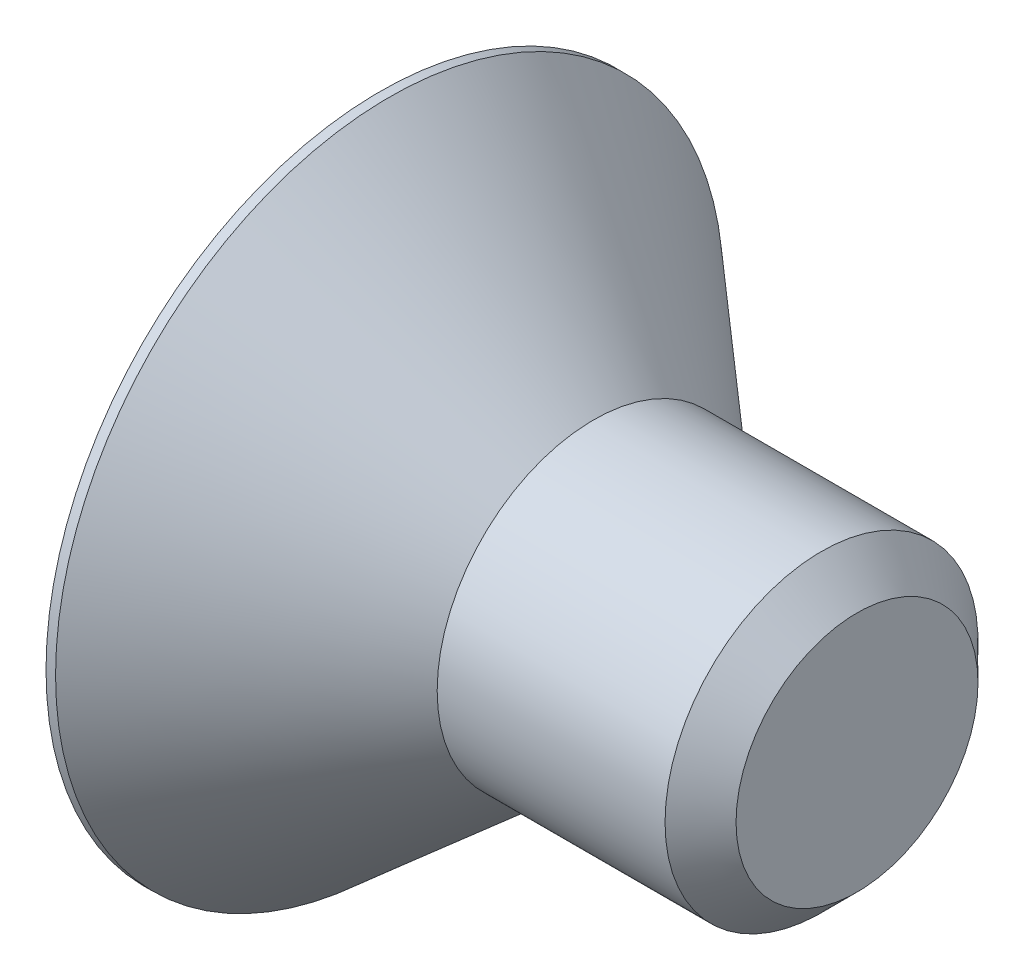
ISO-10303-21;
HEADER;
FILE_DESCRIPTION(('STEP AP214'),'2;1');
FILE_NAME('part.step','',(''),(''),'','','');
FILE_SCHEMA(('AUTOMOTIVE_DESIGN { 1 0 10303 214 1 1 1 1 }'));
ENDSEC;
DATA;
#1=APPLICATION_CONTEXT('core data for automotive mechanical design processes');
#2=APPLICATION_PROTOCOL_DEFINITION('international standard','automotive_design',2000,#1);
#3=PRODUCT_CONTEXT('',#1,'mechanical');
#4=PRODUCT('Part','Part','',(#3));
#5=PRODUCT_RELATED_PRODUCT_CATEGORY('part','',(#4));
#6=PRODUCT_DEFINITION_FORMATION('','',#4);
#7=PRODUCT_DEFINITION_CONTEXT('part definition',#1,'design');
#8=PRODUCT_DEFINITION('design','',#6,#7);
#9=PRODUCT_DEFINITION_SHAPE('','',#8);
#10=(LENGTH_UNIT() NAMED_UNIT(*) SI_UNIT(.MILLI.,.METRE.));
#11=(NAMED_UNIT(*) PLANE_ANGLE_UNIT() SI_UNIT($,.RADIAN.));
#12=(NAMED_UNIT(*) SI_UNIT($,.STERADIAN.) SOLID_ANGLE_UNIT());
#13=UNCERTAINTY_MEASURE_WITH_UNIT(LENGTH_MEASURE(1.E-05),#10,'distance_accuracy_value','');
#14=(GEOMETRIC_REPRESENTATION_CONTEXT(3) GLOBAL_UNCERTAINTY_ASSIGNED_CONTEXT((#13)) GLOBAL_UNIT_ASSIGNED_CONTEXT((#10,
#11,#12)) REPRESENTATION_CONTEXT('',''));
#15=CARTESIAN_POINT('',(0.,0.,0.));
#16=DIRECTION('',(0.,0.,1.));
#17=DIRECTION('',(1.,0.,0.));
#18=AXIS2_PLACEMENT_3D('',#15,#16,#17);
#19=CARTESIAN_POINT('',(0.,0.,0.));
#20=DIRECTION('',(-1.,0.,0.));
#21=DIRECTION('',(0.,0.,1.));
#22=AXIS2_PLACEMENT_3D('',#19,#20,#21);
#23=PLANE('',#22);
#24=CARTESIAN_POINT('',(0.,0.,0.));
#25=DIRECTION('',(-1.,0.,0.));
#26=DIRECTION('',(0.,0.,1.));
#27=AXIS2_PLACEMENT_3D('',#24,#25,#26);
#28=CIRCLE('',#27,4.445);
#29=CARTESIAN_POINT('',(0.,0.,4.445));
#30=VERTEX_POINT('',#29);
#31=EDGE_CURVE('E11',#30,#30,#28,.T.);
#32=ORIENTED_EDGE('',*,*,#31,.T.);
#33=EDGE_LOOP('',(#32));
#34=FACE_BOUND('',#33,.T.);
#35=DIRECTION('',(0.,-0.5,-0.866025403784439));
#36=VECTOR('',#35,1.);
#37=CARTESIAN_POINT('',(0.,-0.689240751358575,1.1938));
#38=LINE('',#37,#36);
#39=CARTESIAN_POINT('',(0.,-0.689240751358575,1.1938));
#40=VERTEX_POINT('',#39);
#41=CARTESIAN_POINT('',(0.,-1.37848150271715,0.));
#42=VERTEX_POINT('',#41);
#43=EDGE_CURVE('E116',#40,#42,#38,.T.);
#44=ORIENTED_EDGE('',*,*,#43,.T.);
#45=DIRECTION('',(0.,0.5,-0.866025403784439));
#46=VECTOR('',#45,1.);
#47=CARTESIAN_POINT('',(0.,-1.37848150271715,0.));
#48=LINE('',#47,#46);
#49=CARTESIAN_POINT('',(0.,-0.689240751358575,-1.1938));
#50=VERTEX_POINT('',#49);
#51=EDGE_CURVE('E47',#42,#50,#48,.T.);
#52=ORIENTED_EDGE('',*,*,#51,.T.);
#53=DIRECTION('',(0.,1.,0.));
#54=VECTOR('',#53,1.);
#55=CARTESIAN_POINT('',(0.,-0.689240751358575,-1.1938));
#56=LINE('',#55,#54);
#57=CARTESIAN_POINT('',(0.,0.689240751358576,-1.1938));
#58=VERTEX_POINT('',#57);
#59=EDGE_CURVE('E127',#50,#58,#56,.T.);
#60=ORIENTED_EDGE('',*,*,#59,.T.);
#61=DIRECTION('',(0.,0.5,0.866025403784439));
#62=VECTOR('',#61,1.);
#63=CARTESIAN_POINT('',(0.,0.689240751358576,-1.1938));
#64=LINE('',#63,#62);
#65=CARTESIAN_POINT('',(0.,1.37848150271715,0.));
#66=VERTEX_POINT('',#65);
#67=EDGE_CURVE('E198',#58,#66,#64,.T.);
#68=ORIENTED_EDGE('',*,*,#67,.T.);
#69=DIRECTION('',(0.,-0.5,0.866025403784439));
#70=VECTOR('',#69,1.);
#71=CARTESIAN_POINT('',(0.,1.37848150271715,0.));
#72=LINE('',#71,#70);
#73=CARTESIAN_POINT('',(0.,0.689240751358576,1.1938));
#74=VERTEX_POINT('',#73);
#75=EDGE_CURVE('E181',#66,#74,#72,.T.);
#76=ORIENTED_EDGE('',*,*,#75,.T.);
#77=DIRECTION('',(0.,-1.,0.));
#78=VECTOR('',#77,1.);
#79=CARTESIAN_POINT('',(0.,0.689240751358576,1.1938));
#80=LINE('',#79,#78);
#81=EDGE_CURVE('E176',#74,#40,#80,.T.);
#82=ORIENTED_EDGE('',*,*,#81,.T.);
#83=EDGE_LOOP('',(#44,#52,#60,#68,#76,#82));
#84=FACE_BOUND('',#83,.T.);
#85=ADVANCED_FACE('F33',(#34,#84),#23,.T.);
#86=CARTESIAN_POINT('',(0.,0.,0.));
#87=DIRECTION('',(-1.,0.,0.));
#88=DIRECTION('',(0.,0.,1.));
#89=AXIS2_PLACEMENT_3D('',#86,#87,#88);
#90=CYLINDRICAL_SURFACE('',#89,4.445);
#91=CARTESIAN_POINT('',(0.127,0.,0.));
#92=DIRECTION('',(-1.,0.,0.));
#93=DIRECTION('',(0.,0.,1.));
#94=AXIS2_PLACEMENT_3D('',#91,#92,#93);
#95=CIRCLE('',#94,4.445);
#96=CARTESIAN_POINT('',(0.127,0.,4.445));
#97=VERTEX_POINT('',#96);
#98=EDGE_CURVE('E40',#97,#97,#95,.T.);
#99=ORIENTED_EDGE('',*,*,#98,.T.);
#100=EDGE_LOOP('',(#99));
#101=FACE_BOUND('',#100,.T.);
#102=ORIENTED_EDGE('',*,*,#31,.F.);
#103=EDGE_LOOP('',(#102));
#104=FACE_BOUND('',#103,.T.);
#105=ADVANCED_FACE('F152',(#101,#104),#90,.T.);
#106=CARTESIAN_POINT('',(0.127,0.,0.));
#107=DIRECTION('',(-1.,0.,0.));
#108=DIRECTION('',(0.,0.,1.));
#109=AXIS2_PLACEMENT_3D('',#106,#107,#108);
#110=CONICAL_SURFACE('',#109,4.445,0.715584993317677);
#111=CARTESIAN_POINT('',(2.84440025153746,0.,0.));
#112=DIRECTION('',(-1.,0.,0.));
#113=DIRECTION('',(0.,0.,1.));
#114=AXIS2_PLACEMENT_3D('',#111,#112,#113);
#115=CIRCLE('',#114,2.0828);
#116=CARTESIAN_POINT('',(2.84440025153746,0.,2.0828));
#117=VERTEX_POINT('',#116);
#118=EDGE_CURVE('E147',#117,#117,#115,.T.);
#119=ORIENTED_EDGE('',*,*,#118,.T.);
#120=EDGE_LOOP('',(#119));
#121=FACE_BOUND('',#120,.T.);
#122=ORIENTED_EDGE('',*,*,#98,.F.);
#123=EDGE_LOOP('',(#122));
#124=FACE_BOUND('',#123,.T.);
#125=ADVANCED_FACE('F155',(#121,#124),#110,.T.);
#126=CARTESIAN_POINT('',(0.,0.,0.));
#127=DIRECTION('',(-1.,0.,0.));
#128=DIRECTION('',(0.,0.,1.));
#129=AXIS2_PLACEMENT_3D('',#126,#127,#128);
#130=CYLINDRICAL_SURFACE('',#129,2.08279999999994);
#131=CARTESIAN_POINT('',(5.8775599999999,0.,0.));
#132=DIRECTION('',(-1.,0.,0.));
#133=DIRECTION('',(0.,0.,1.));
#134=AXIS2_PLACEMENT_3D('',#131,#132,#133);
#135=CIRCLE('',#134,2.08279999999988);
#136=CARTESIAN_POINT('',(5.8775599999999,0.,2.08279999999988));
#137=VERTEX_POINT('',#136);
#138=EDGE_CURVE('E144',#137,#137,#135,.T.);
#139=ORIENTED_EDGE('',*,*,#138,.T.);
#140=EDGE_LOOP('',(#139));
#141=FACE_BOUND('',#140,.T.);
#142=ORIENTED_EDGE('',*,*,#118,.F.);
#143=EDGE_LOOP('',(#142));
#144=FACE_BOUND('',#143,.T.);
#145=ADVANCED_FACE('F157',(#141,#144),#130,.T.);
#146=CARTESIAN_POINT('',(6.35,0.,0.));
#147=DIRECTION('',(-1.,0.,0.));
#148=DIRECTION('',(0.,0.,1.));
#149=AXIS2_PLACEMENT_3D('',#146,#147,#148);
#150=CONICAL_SURFACE('',#149,1.61036,0.785398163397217);
#151=ORIENTED_EDGE('',*,*,#138,.F.);
#152=EDGE_LOOP('',(#151));
#153=FACE_BOUND('',#152,.T.);
#154=CARTESIAN_POINT('',(6.35,0.,0.));
#155=DIRECTION('',(-1.,0.,0.));
#156=DIRECTION('',(0.,0.,1.));
#157=AXIS2_PLACEMENT_3D('',#154,#155,#156);
#158=CIRCLE('',#157,1.61036);
#159=CARTESIAN_POINT('',(6.35,0.,1.61036));
#160=VERTEX_POINT('',#159);
#161=EDGE_CURVE('E140',#160,#160,#158,.T.);
#162=ORIENTED_EDGE('',*,*,#161,.T.);
#163=EDGE_LOOP('',(#162));
#164=FACE_BOUND('',#163,.T.);
#165=ADVANCED_FACE('F164',(#153,#164),#150,.T.);
#166=CARTESIAN_POINT('',(6.35,1.61036,0.));
#167=DIRECTION('',(1.,0.,0.));
#168=DIRECTION('',(0.,0.,-1.));
#169=AXIS2_PLACEMENT_3D('',#166,#167,#168);
#170=PLANE('',#169);
#171=ORIENTED_EDGE('',*,*,#161,.F.);
#172=EDGE_LOOP('',(#171));
#173=FACE_BOUND('',#172,.T.);
#174=ADVANCED_FACE('F264',(#173),#170,.T.);
#175=CARTESIAN_POINT('',(1.9304,-1.37848150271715,0.));
#176=DIRECTION('',(0.,0.866025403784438,0.5));
#177=DIRECTION('',(0.,-0.5,0.866025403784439));
#178=AXIS2_PLACEMENT_3D('',#175,#176,#177);
#179=PLANE('',#178);
#180=ORIENTED_EDGE('',*,*,#51,.F.);
#181=DIRECTION('',(-1.,0.,0.));
#182=VECTOR('',#181,1.);
#183=CARTESIAN_POINT('',(1.9304,-1.37848150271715,0.));
#184=LINE('',#183,#182);
#185=CARTESIAN_POINT('',(1.9304,-1.37848150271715,0.));
#186=VERTEX_POINT('',#185);
#187=EDGE_CURVE('E185',#186,#42,#184,.T.);
#188=ORIENTED_EDGE('',*,*,#187,.F.);
#189=DIRECTION('',(0.,0.5,-0.866025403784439));
#190=VECTOR('',#189,1.);
#191=CARTESIAN_POINT('',(1.9304,-1.37848150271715,0.));
#192=LINE('',#191,#190);
#193=CARTESIAN_POINT('',(1.9304,-1.03386112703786,-0.5969));
#194=VERTEX_POINT('',#193);
#195=EDGE_CURVE('E112',#186,#194,#192,.T.);
#196=ORIENTED_EDGE('',*,*,#195,.T.);
#197=CARTESIAN_POINT('',(1.9304,-0.689240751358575,-1.1938));
#198=VERTEX_POINT('',#197);
#199=EDGE_CURVE('E108',#194,#198,#192,.T.);
#200=ORIENTED_EDGE('',*,*,#199,.T.);
#201=DIRECTION('',(-1.,0.,0.));
#202=VECTOR('',#201,1.);
#203=CARTESIAN_POINT('',(1.9304,-0.689240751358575,-1.1938));
#204=LINE('',#203,#202);
#205=EDGE_CURVE('E110',#198,#50,#204,.T.);
#206=ORIENTED_EDGE('',*,*,#205,.T.);
#207=EDGE_LOOP('',(#180,#188,#196,#200,#206));
#208=FACE_BOUND('',#207,.T.);
#209=ADVANCED_FACE('F109',(#208),#179,.T.);
#210=CARTESIAN_POINT('',(1.9304,-0.689240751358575,-1.1938));
#211=DIRECTION('',(0.,0.,1.));
#212=DIRECTION('',(1.,0.,0.));
#213=AXIS2_PLACEMENT_3D('',#210,#211,#212);
#214=PLANE('',#213);
#215=ORIENTED_EDGE('',*,*,#59,.F.);
#216=ORIENTED_EDGE('',*,*,#205,.F.);
#217=DIRECTION('',(0.,1.,0.));
#218=VECTOR('',#217,1.);
#219=CARTESIAN_POINT('',(1.9304,-0.689240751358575,-1.1938));
#220=LINE('',#219,#218);
#221=CARTESIAN_POINT('',(1.9304,0.,-1.1938));
#222=VERTEX_POINT('',#221);
#223=EDGE_CURVE('E55',#198,#222,#220,.T.);
#224=ORIENTED_EDGE('',*,*,#223,.T.);
#225=CARTESIAN_POINT('',(1.9304,0.689240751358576,-1.1938));
#226=VERTEX_POINT('',#225);
#227=EDGE_CURVE('E122',#222,#226,#220,.T.);
#228=ORIENTED_EDGE('',*,*,#227,.T.);
#229=DIRECTION('',(-1.,0.,0.));
#230=VECTOR('',#229,1.);
#231=CARTESIAN_POINT('',(1.9304,0.689240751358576,-1.1938));
#232=LINE('',#231,#230);
#233=EDGE_CURVE('E129',#226,#58,#232,.T.);
#234=ORIENTED_EDGE('',*,*,#233,.T.);
#235=EDGE_LOOP('',(#215,#216,#224,#228,#234));
#236=FACE_BOUND('',#235,.T.);
#237=ADVANCED_FACE('F124',(#236),#214,.T.);
#238=CARTESIAN_POINT('',(1.9304,0.689240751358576,-1.1938));
#239=DIRECTION('',(0.,-0.866025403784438,0.5));
#240=DIRECTION('',(0.,-0.5,-0.866025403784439));
#241=AXIS2_PLACEMENT_3D('',#238,#239,#240);
#242=PLANE('',#241);
#243=ORIENTED_EDGE('',*,*,#67,.F.);
#244=ORIENTED_EDGE('',*,*,#233,.F.);
#245=DIRECTION('',(0.,0.5,0.866025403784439));
#246=VECTOR('',#245,1.);
#247=CARTESIAN_POINT('',(1.9304,0.689240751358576,-1.1938));
#248=LINE('',#247,#246);
#249=CARTESIAN_POINT('',(1.9304,1.03386112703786,-0.5969));
#250=VERTEX_POINT('',#249);
#251=EDGE_CURVE('E218',#226,#250,#248,.T.);
#252=ORIENTED_EDGE('',*,*,#251,.T.);
#253=CARTESIAN_POINT('',(1.9304,1.37848150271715,0.));
#254=VERTEX_POINT('',#253);
#255=EDGE_CURVE('E121',#250,#254,#248,.T.);
#256=ORIENTED_EDGE('',*,*,#255,.T.);
#257=DIRECTION('',(-1.,0.,0.));
#258=VECTOR('',#257,1.);
#259=CARTESIAN_POINT('',(1.9304,1.37848150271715,0.));
#260=LINE('',#259,#258);
#261=EDGE_CURVE('E135',#254,#66,#260,.T.);
#262=ORIENTED_EDGE('',*,*,#261,.T.);
#263=EDGE_LOOP('',(#243,#244,#252,#256,#262));
#264=FACE_BOUND('',#263,.T.);
#265=ADVANCED_FACE('F196',(#264),#242,.T.);
#266=CARTESIAN_POINT('',(1.9304,1.37848150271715,0.));
#267=DIRECTION('',(0.,-0.866025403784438,-0.5));
#268=DIRECTION('',(0.,0.5,-0.866025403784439));
#269=AXIS2_PLACEMENT_3D('',#266,#267,#268);
#270=PLANE('',#269);
#271=ORIENTED_EDGE('',*,*,#75,.F.);
#272=ORIENTED_EDGE('',*,*,#261,.F.);
#273=DIRECTION('',(0.,-0.5,0.866025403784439));
#274=VECTOR('',#273,1.);
#275=CARTESIAN_POINT('',(1.9304,1.37848150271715,0.));
#276=LINE('',#275,#274);
#277=CARTESIAN_POINT('',(1.9304,1.03386112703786,0.5969));
#278=VERTEX_POINT('',#277);
#279=EDGE_CURVE('E215',#254,#278,#276,.T.);
#280=ORIENTED_EDGE('',*,*,#279,.T.);
#281=CARTESIAN_POINT('',(1.9304,0.689240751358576,1.1938));
#282=VERTEX_POINT('',#281);
#283=EDGE_CURVE('E217',#278,#282,#276,.T.);
#284=ORIENTED_EDGE('',*,*,#283,.T.);
#285=DIRECTION('',(-1.,0.,0.));
#286=VECTOR('',#285,1.);
#287=CARTESIAN_POINT('',(1.9304,0.689240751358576,1.1938));
#288=LINE('',#287,#286);
#289=EDGE_CURVE('E190',#282,#74,#288,.T.);
#290=ORIENTED_EDGE('',*,*,#289,.T.);
#291=EDGE_LOOP('',(#271,#272,#280,#284,#290));
#292=FACE_BOUND('',#291,.T.);
#293=ADVANCED_FACE('F228',(#292),#270,.T.);
#294=CARTESIAN_POINT('',(1.9304,0.689240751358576,1.1938));
#295=DIRECTION('',(0.,0.,-1.));
#296=DIRECTION('',(-1.,0.,0.));
#297=AXIS2_PLACEMENT_3D('',#294,#295,#296);
#298=PLANE('',#297);
#299=ORIENTED_EDGE('',*,*,#81,.F.);
#300=ORIENTED_EDGE('',*,*,#289,.F.);
#301=DIRECTION('',(0.,-1.,0.));
#302=VECTOR('',#301,1.);
#303=CARTESIAN_POINT('',(1.9304,0.689240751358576,1.1938));
#304=LINE('',#303,#302);
#305=CARTESIAN_POINT('',(1.9304,0.,1.1938));
#306=VERTEX_POINT('',#305);
#307=EDGE_CURVE('E211',#282,#306,#304,.T.);
#308=ORIENTED_EDGE('',*,*,#307,.T.);
#309=CARTESIAN_POINT('',(1.9304,-0.689240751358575,1.1938));
#310=VERTEX_POINT('',#309);
#311=EDGE_CURVE('E214',#306,#310,#304,.T.);
#312=ORIENTED_EDGE('',*,*,#311,.T.);
#313=DIRECTION('',(-1.,0.,0.));
#314=VECTOR('',#313,1.);
#315=CARTESIAN_POINT('',(1.9304,-0.689240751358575,1.1938));
#316=LINE('',#315,#314);
#317=EDGE_CURVE('E187',#310,#40,#316,.T.);
#318=ORIENTED_EDGE('',*,*,#317,.T.);
#319=EDGE_LOOP('',(#299,#300,#308,#312,#318));
#320=FACE_BOUND('',#319,.T.);
#321=ADVANCED_FACE('F241',(#320),#298,.T.);
#322=CARTESIAN_POINT('',(1.9304,-0.689240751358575,1.1938));
#323=DIRECTION('',(0.,0.866025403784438,-0.5));
#324=DIRECTION('',(0.,0.5,0.866025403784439));
#325=AXIS2_PLACEMENT_3D('',#322,#323,#324);
#326=PLANE('',#325);
#327=ORIENTED_EDGE('',*,*,#43,.F.);
#328=ORIENTED_EDGE('',*,*,#317,.F.);
#329=DIRECTION('',(0.,-0.5,-0.866025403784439));
#330=VECTOR('',#329,1.);
#331=CARTESIAN_POINT('',(1.9304,-0.689240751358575,1.1938));
#332=LINE('',#331,#330);
#333=CARTESIAN_POINT('',(1.9304,-1.03386112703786,0.5969));
#334=VERTEX_POINT('',#333);
#335=EDGE_CURVE('E188',#310,#334,#332,.T.);
#336=ORIENTED_EDGE('',*,*,#335,.T.);
#337=EDGE_CURVE('E210',#334,#186,#332,.T.);
#338=ORIENTED_EDGE('',*,*,#337,.T.);
#339=ORIENTED_EDGE('',*,*,#187,.T.);
#340=EDGE_LOOP('',(#327,#328,#336,#338,#339));
#341=FACE_BOUND('',#340,.T.);
#342=ADVANCED_FACE('F242',(#341),#326,.T.);
#343=CARTESIAN_POINT('',(1.9304,0.,-2.3876));
#344=DIRECTION('',(1.,0.,0.));
#345=DIRECTION('',(0.,0.,-1.));
#346=AXIS2_PLACEMENT_3D('',#343,#344,#345);
#347=PLANE('',#346);
#348=ORIENTED_EDGE('',*,*,#223,.F.);
#349=ORIENTED_EDGE('',*,*,#199,.F.);
#350=CARTESIAN_POINT('',(1.9304,0.,0.));
#351=DIRECTION('',(-1.,0.,0.));
#352=DIRECTION('',(0.,0.,1.));
#353=AXIS2_PLACEMENT_3D('',#350,#351,#352);
#354=CIRCLE('',#353,1.1938);
#355=EDGE_CURVE('E119',#222,#194,#354,.T.);
#356=ORIENTED_EDGE('',*,*,#355,.F.);
#357=EDGE_LOOP('',(#348,#349,#356));
#358=FACE_BOUND('',#357,.T.);
#359=ADVANCED_FACE('F118',(#358),#347,.F.);
#360=ORIENTED_EDGE('',*,*,#195,.F.);
#361=ORIENTED_EDGE('',*,*,#337,.F.);
#362=EDGE_CURVE('E132',#194,#334,#354,.T.);
#363=ORIENTED_EDGE('',*,*,#362,.F.);
#364=EDGE_LOOP('',(#360,#361,#363));
#365=FACE_BOUND('',#364,.T.);
#366=ADVANCED_FACE('F244',(#365),#347,.F.);
#367=ORIENTED_EDGE('',*,*,#335,.F.);
#368=ORIENTED_EDGE('',*,*,#311,.F.);
#369=EDGE_CURVE('E128',#334,#306,#354,.T.);
#370=ORIENTED_EDGE('',*,*,#369,.F.);
#371=EDGE_LOOP('',(#367,#368,#370));
#372=FACE_BOUND('',#371,.T.);
#373=ADVANCED_FACE('F238',(#372),#347,.F.);
#374=ORIENTED_EDGE('',*,*,#307,.F.);
#375=ORIENTED_EDGE('',*,*,#283,.F.);
#376=EDGE_CURVE('E134',#306,#278,#354,.T.);
#377=ORIENTED_EDGE('',*,*,#376,.F.);
#378=EDGE_LOOP('',(#374,#375,#377));
#379=FACE_BOUND('',#378,.T.);
#380=ADVANCED_FACE('F235',(#379),#347,.F.);
#381=ORIENTED_EDGE('',*,*,#279,.F.);
#382=ORIENTED_EDGE('',*,*,#255,.F.);
#383=EDGE_CURVE('E141',#278,#250,#354,.T.);
#384=ORIENTED_EDGE('',*,*,#383,.F.);
#385=EDGE_LOOP('',(#381,#382,#384));
#386=FACE_BOUND('',#385,.T.);
#387=ADVANCED_FACE('F226',(#386),#347,.F.);
#388=ORIENTED_EDGE('',*,*,#251,.F.);
#389=ORIENTED_EDGE('',*,*,#227,.F.);
#390=EDGE_CURVE('E223',#250,#222,#354,.T.);
#391=ORIENTED_EDGE('',*,*,#390,.F.);
#392=EDGE_LOOP('',(#388,#389,#391));
#393=FACE_BOUND('',#392,.T.);
#394=ADVANCED_FACE('F222',(#393),#347,.F.);
#395=CARTESIAN_POINT('',(1.9304,0.,0.));
#396=DIRECTION('',(-1.,0.,0.));
#397=DIRECTION('',(0.,0.,1.));
#398=AXIS2_PLACEMENT_3D('',#395,#396,#397);
#399=CONICAL_SURFACE('',#398,1.1938,1.04719755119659);
#400=CARTESIAN_POINT('',(2.61964075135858,0.,0.));
#401=VERTEX_POINT('',#400);
#402=VERTEX_LOOP('',#401);
#403=FACE_BOUND('',#402,.T.);
#404=ORIENTED_EDGE('',*,*,#376,.T.);
#405=ORIENTED_EDGE('',*,*,#383,.T.);
#406=ORIENTED_EDGE('',*,*,#390,.T.);
#407=ORIENTED_EDGE('',*,*,#355,.T.);
#408=ORIENTED_EDGE('',*,*,#362,.T.);
#409=ORIENTED_EDGE('',*,*,#369,.T.);
#410=EDGE_LOOP('',(#404,#405,#406,#407,#408,#409));
#411=FACE_BOUND('',#410,.T.);
#412=ADVANCED_FACE('F230',(#403,#411),#399,.F.);
#413=CLOSED_SHELL('',(#85,#105,#125,#145,#165,#174,#209,#237,#265,#293,#321,#342,#359,#366,#373,
#380,#387,#394,#412));
#414=MANIFOLD_SOLID_BREP('B2',#413);
#415=ADVANCED_BREP_SHAPE_REPRESENTATION('',(#18,#414),#14);
#416=SHAPE_DEFINITION_REPRESENTATION(#9,#415);
ENDSEC;
END-ISO-10303-21;
